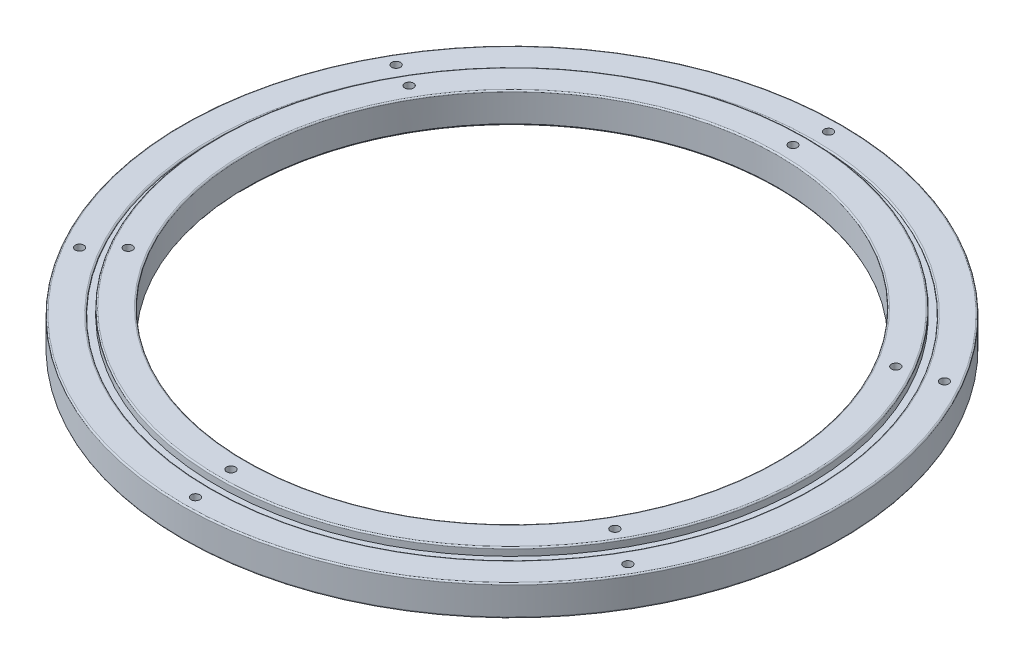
ISO-10303-21;
HEADER;
FILE_DESCRIPTION(('STEP AP214'),'2;1');
FILE_NAME('part.step','',(''),(''),'','','');
FILE_SCHEMA(('AUTOMOTIVE_DESIGN { 1 0 10303 214 1 1 1 1 }'));
ENDSEC;
DATA;
#1=APPLICATION_CONTEXT('core data for automotive mechanical design processes');
#2=APPLICATION_PROTOCOL_DEFINITION('international standard','automotive_design',2000,#1);
#3=PRODUCT_CONTEXT('',#1,'mechanical');
#4=PRODUCT('Part','Part','',(#3));
#5=PRODUCT_RELATED_PRODUCT_CATEGORY('part','',(#4));
#6=PRODUCT_DEFINITION_FORMATION('','',#4);
#7=PRODUCT_DEFINITION_CONTEXT('part definition',#1,'design');
#8=PRODUCT_DEFINITION('design','',#6,#7);
#9=PRODUCT_DEFINITION_SHAPE('','',#8);
#10=(LENGTH_UNIT() NAMED_UNIT(*) SI_UNIT(.MILLI.,.METRE.));
#11=(NAMED_UNIT(*) PLANE_ANGLE_UNIT() SI_UNIT($,.RADIAN.));
#12=(NAMED_UNIT(*) SI_UNIT($,.STERADIAN.) SOLID_ANGLE_UNIT());
#13=UNCERTAINTY_MEASURE_WITH_UNIT(LENGTH_MEASURE(1.E-05),#10,'distance_accuracy_value','');
#14=(GEOMETRIC_REPRESENTATION_CONTEXT(3) GLOBAL_UNCERTAINTY_ASSIGNED_CONTEXT((#13)) GLOBAL_UNIT_ASSIGNED_CONTEXT((#10,
#11,#12)) REPRESENTATION_CONTEXT('',''));
#15=CARTESIAN_POINT('',(0.,0.,0.));
#16=DIRECTION('',(0.,0.,1.));
#17=DIRECTION('',(1.,0.,0.));
#18=AXIS2_PLACEMENT_3D('',#15,#16,#17);
#19=CARTESIAN_POINT('',(-122.5169,16.9,0.));
#20=DIRECTION('',(0.,-1.,0.));
#21=DIRECTION('',(0.,0.,-1.));
#22=AXIS2_PLACEMENT_3D('',#19,#20,#21);
#23=PLANE('',#22);
#24=CARTESIAN_POINT('',(112.239923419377,16.9,-64.801749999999));
#25=DIRECTION('',(0.,1.,0.));
#26=DIRECTION('',(0.,0.,1.));
#27=AXIS2_PLACEMENT_3D('',#24,#25,#26);
#28=CIRCLE('',#27,2.);
#29=CARTESIAN_POINT('',(112.239923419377,16.9,-62.801749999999));
#30=VERTEX_POINT('',#29);
#31=EDGE_CURVE('E78',#30,#30,#28,.T.);
#32=ORIENTED_EDGE('',*,*,#31,.F.);
#33=EDGE_LOOP('',(#32));
#34=FACE_BOUND('',#33,.T.);
#35=CARTESIAN_POINT('',(0.,16.9,-129.6035));
#36=DIRECTION('',(0.,1.,0.));
#37=DIRECTION('',(0.,0.,1.));
#38=AXIS2_PLACEMENT_3D('',#35,#36,#37);
#39=CIRCLE('',#38,2.);
#40=CARTESIAN_POINT('',(0.,16.9,-127.6035));
#41=VERTEX_POINT('',#40);
#42=EDGE_CURVE('E74',#41,#41,#39,.T.);
#43=ORIENTED_EDGE('',*,*,#42,.F.);
#44=EDGE_LOOP('',(#43));
#45=FACE_BOUND('',#44,.T.);
#46=CARTESIAN_POINT('',(-112.239923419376,16.9,-64.8017500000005));
#47=DIRECTION('',(0.,1.,0.));
#48=DIRECTION('',(0.,0.,1.));
#49=AXIS2_PLACEMENT_3D('',#46,#47,#48);
#50=CIRCLE('',#49,2.);
#51=CARTESIAN_POINT('',(-112.239923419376,16.9,-62.8017500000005));
#52=VERTEX_POINT('',#51);
#53=EDGE_CURVE('E70',#52,#52,#50,.T.);
#54=ORIENTED_EDGE('',*,*,#53,.F.);
#55=EDGE_LOOP('',(#54));
#56=FACE_BOUND('',#55,.T.);
#57=CARTESIAN_POINT('',(-112.239923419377,16.9,64.8017499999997));
#58=DIRECTION('',(0.,1.,0.));
#59=DIRECTION('',(0.,0.,1.));
#60=AXIS2_PLACEMENT_3D('',#57,#58,#59);
#61=CIRCLE('',#60,2.);
#62=CARTESIAN_POINT('',(-112.239923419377,16.9,66.8017499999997));
#63=VERTEX_POINT('',#62);
#64=EDGE_CURVE('E65',#63,#63,#61,.T.);
#65=ORIENTED_EDGE('',*,*,#64,.F.);
#66=EDGE_LOOP('',(#65));
#67=FACE_BOUND('',#66,.T.);
#68=CARTESIAN_POINT('',(0.,16.9,129.6035));
#69=DIRECTION('',(0.,1.,0.));
#70=DIRECTION('',(0.,0.,1.));
#71=AXIS2_PLACEMENT_3D('',#68,#69,#70);
#72=CIRCLE('',#71,2.);
#73=CARTESIAN_POINT('',(0.,16.9,131.6035));
#74=VERTEX_POINT('',#73);
#75=EDGE_CURVE('E60',#74,#74,#72,.T.);
#76=ORIENTED_EDGE('',*,*,#75,.F.);
#77=EDGE_LOOP('',(#76));
#78=FACE_BOUND('',#77,.T.);
#79=CARTESIAN_POINT('',(0.,16.9,0.));
#80=DIRECTION('',(0.,-1.,0.));
#81=DIRECTION('',(0.,0.,-1.));
#82=AXIS2_PLACEMENT_3D('',#79,#80,#81);
#83=CIRCLE('',#82,135.14255);
#84=CARTESIAN_POINT('',(0.,16.9,-135.14255));
#85=VERTEX_POINT('',#84);
#86=EDGE_CURVE('E136',#85,#85,#83,.F.);
#87=ORIENTED_EDGE('',*,*,#86,.T.);
#88=EDGE_LOOP('',(#87));
#89=FACE_BOUND('',#88,.T.);
#90=CARTESIAN_POINT('',(0.,16.9,0.));
#91=DIRECTION('',(0.,-1.,0.));
#92=DIRECTION('',(0.,0.,-1.));
#93=AXIS2_PLACEMENT_3D('',#90,#91,#92);
#94=CIRCLE('',#93,123.1519);
#95=CARTESIAN_POINT('',(0.,16.9,-123.1519));
#96=VERTEX_POINT('',#95);
#97=EDGE_CURVE('E133',#96,#96,#94,.T.);
#98=ORIENTED_EDGE('',*,*,#97,.T.);
#99=EDGE_LOOP('',(#98));
#100=FACE_BOUND('',#99,.T.);
#101=CARTESIAN_POINT('',(112.239923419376,16.9,64.8017500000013));
#102=DIRECTION('',(0.,1.,0.));
#103=DIRECTION('',(0.,0.,1.));
#104=AXIS2_PLACEMENT_3D('',#101,#102,#103);
#105=CIRCLE('',#104,2.);
#106=CARTESIAN_POINT('',(112.239923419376,16.9,66.8017500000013));
#107=VERTEX_POINT('',#106);
#108=EDGE_CURVE('E557',#107,#107,#105,.T.);
#109=ORIENTED_EDGE('',*,*,#108,.F.);
#110=EDGE_LOOP('',(#109));
#111=FACE_BOUND('',#110,.T.);
#112=ADVANCED_FACE('F39',(#34,#45,#56,#67,#78,#89,#100,#111),#23,.F.);
#113=CARTESIAN_POINT('',(0.,0.,0.));
#114=DIRECTION('',(0.,-1.,0.));
#115=DIRECTION('',(0.,0.,-1.));
#116=AXIS2_PLACEMENT_3D('',#113,#114,#115);
#117=CYLINDRICAL_SURFACE('',#116,122.5169);
#118=CARTESIAN_POINT('',(0.,3.535,0.));
#119=DIRECTION('',(0.,1.,0.));
#120=DIRECTION('',(0.,0.,1.));
#121=AXIS2_PLACEMENT_3D('',#118,#119,#120);
#122=CIRCLE('',#121,122.5169);
#123=CARTESIAN_POINT('',(0.,3.535,122.5169));
#124=VERTEX_POINT('',#123);
#125=EDGE_CURVE('E142',#124,#124,#122,.F.);
#126=ORIENTED_EDGE('',*,*,#125,.T.);
#127=EDGE_LOOP('',(#126));
#128=FACE_BOUND('',#127,.T.);
#129=CARTESIAN_POINT('',(0.,16.265,0.));
#130=DIRECTION('',(0.,-1.,0.));
#131=DIRECTION('',(0.,0.,-1.));
#132=AXIS2_PLACEMENT_3D('',#129,#130,#131);
#133=CIRCLE('',#132,122.5169);
#134=CARTESIAN_POINT('',(0.,16.265,-122.5169));
#135=VERTEX_POINT('',#134);
#136=EDGE_CURVE('E139',#135,#135,#133,.F.);
#137=ORIENTED_EDGE('',*,*,#136,.T.);
#138=EDGE_LOOP('',(#137));
#139=FACE_BOUND('',#138,.T.);
#140=ADVANCED_FACE('F181',(#128,#139),#117,.F.);
#141=CARTESIAN_POINT('',(0.,0.,0.));
#142=DIRECTION('',(0.,-1.,0.));
#143=DIRECTION('',(0.,0.,-1.));
#144=AXIS2_PLACEMENT_3D('',#141,#142,#143);
#145=CYLINDRICAL_SURFACE('',#144,135.77755);
#146=CARTESIAN_POINT('',(0.,16.265,0.));
#147=DIRECTION('',(0.,-1.,0.));
#148=DIRECTION('',(0.,0.,-1.));
#149=AXIS2_PLACEMENT_3D('',#146,#147,#148);
#150=CIRCLE('',#149,135.77755);
#151=CARTESIAN_POINT('',(0.,16.265,-135.77755));
#152=VERTEX_POINT('',#151);
#153=EDGE_CURVE('E130',#152,#152,#150,.T.);
#154=ORIENTED_EDGE('',*,*,#153,.T.);
#155=EDGE_LOOP('',(#154));
#156=FACE_BOUND('',#155,.T.);
#157=CARTESIAN_POINT('',(0.,13.365,0.));
#158=DIRECTION('',(0.,-1.,0.));
#159=DIRECTION('',(0.,0.,-1.));
#160=AXIS2_PLACEMENT_3D('',#157,#158,#159);
#161=CIRCLE('',#160,135.77755);
#162=CARTESIAN_POINT('',(0.,13.365,-135.77755));
#163=VERTEX_POINT('',#162);
#164=EDGE_CURVE('E127',#163,#163,#161,.T.);
#165=ORIENTED_EDGE('',*,*,#164,.F.);
#166=EDGE_LOOP('',(#165));
#167=FACE_BOUND('',#166,.T.);
#168=ADVANCED_FACE('F187',(#156,#167),#145,.T.);
#169=CARTESIAN_POINT('',(-138.74935,13.365,0.));
#170=DIRECTION('',(0.,-1.,0.));
#171=DIRECTION('',(0.,0.,-1.));
#172=AXIS2_PLACEMENT_3D('',#169,#170,#171);
#173=PLANE('',#172);
#174=CARTESIAN_POINT('',(0.,13.365,0.));
#175=DIRECTION('',(0.,-1.,0.));
#176=DIRECTION('',(0.,0.,-1.));
#177=AXIS2_PLACEMENT_3D('',#174,#175,#176);
#178=CIRCLE('',#177,138.74935);
#179=CARTESIAN_POINT('',(0.,13.365,-138.74935));
#180=VERTEX_POINT('',#179);
#181=EDGE_CURVE('E124',#180,#180,#178,.T.);
#182=ORIENTED_EDGE('',*,*,#181,.F.);
#183=EDGE_LOOP('',(#182));
#184=FACE_BOUND('',#183,.T.);
#185=ORIENTED_EDGE('',*,*,#164,.T.);
#186=EDGE_LOOP('',(#185));
#187=FACE_BOUND('',#186,.T.);
#188=ADVANCED_FACE('F238',(#184,#187),#173,.F.);
#189=CARTESIAN_POINT('',(-138.74935,14.,0.));
#190=DIRECTION('',(0.,-1.,0.));
#191=DIRECTION('',(0.,0.,-1.));
#192=AXIS2_PLACEMENT_3D('',#189,#190,#191);
#193=PLANE('',#192);
#194=CARTESIAN_POINT('',(126.450014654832,14.,73.0059500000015));
#195=DIRECTION('',(0.,-1.,0.));
#196=DIRECTION('',(0.,0.,-1.));
#197=AXIS2_PLACEMENT_3D('',#194,#195,#196);
#198=CIRCLE('',#197,2.);
#199=CARTESIAN_POINT('',(126.450014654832,14.,71.0059500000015));
#200=VERTEX_POINT('',#199);
#201=EDGE_CURVE('E558',#200,#200,#198,.T.);
#202=ORIENTED_EDGE('',*,*,#201,.T.);
#203=EDGE_LOOP('',(#202));
#204=FACE_BOUND('',#203,.T.);
#205=CARTESIAN_POINT('',(126.450014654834,14.,-73.0059499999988));
#206=DIRECTION('',(0.,-1.,0.));
#207=DIRECTION('',(0.,0.,-1.));
#208=AXIS2_PLACEMENT_3D('',#205,#206,#207);
#209=CIRCLE('',#208,2.);
#210=CARTESIAN_POINT('',(126.450014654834,14.,-75.0059499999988));
#211=VERTEX_POINT('',#210);
#212=EDGE_CURVE('E85',#211,#211,#209,.T.);
#213=ORIENTED_EDGE('',*,*,#212,.T.);
#214=EDGE_LOOP('',(#213));
#215=FACE_BOUND('',#214,.T.);
#216=CARTESIAN_POINT('',(0.,14.,-146.0119));
#217=DIRECTION('',(0.,-1.,0.));
#218=DIRECTION('',(0.,0.,-1.));
#219=AXIS2_PLACEMENT_3D('',#216,#217,#218);
#220=CIRCLE('',#219,2.);
#221=CARTESIAN_POINT('',(0.,14.,-148.0119));
#222=VERTEX_POINT('',#221);
#223=EDGE_CURVE('E82',#222,#222,#220,.T.);
#224=ORIENTED_EDGE('',*,*,#223,.T.);
#225=EDGE_LOOP('',(#224));
#226=FACE_BOUND('',#225,.T.);
#227=CARTESIAN_POINT('',(-126.450014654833,14.,-73.0059500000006));
#228=DIRECTION('',(0.,-1.,0.));
#229=DIRECTION('',(0.,0.,-1.));
#230=AXIS2_PLACEMENT_3D('',#227,#228,#229);
#231=CIRCLE('',#230,2.);
#232=CARTESIAN_POINT('',(-126.450014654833,14.,-75.0059500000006));
#233=VERTEX_POINT('',#232);
#234=EDGE_CURVE('E100',#233,#233,#231,.T.);
#235=ORIENTED_EDGE('',*,*,#234,.T.);
#236=EDGE_LOOP('',(#235));
#237=FACE_BOUND('',#236,.T.);
#238=CARTESIAN_POINT('',(-126.450014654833,14.,73.0059499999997));
#239=DIRECTION('',(0.,-1.,0.));
#240=DIRECTION('',(0.,0.,-1.));
#241=AXIS2_PLACEMENT_3D('',#238,#239,#240);
#242=CIRCLE('',#241,2.);
#243=CARTESIAN_POINT('',(-126.450014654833,14.,71.0059499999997));
#244=VERTEX_POINT('',#243);
#245=EDGE_CURVE('E107',#244,#244,#242,.T.);
#246=ORIENTED_EDGE('',*,*,#245,.T.);
#247=EDGE_LOOP('',(#246));
#248=FACE_BOUND('',#247,.T.);
#249=CARTESIAN_POINT('',(0.,14.,146.0119));
#250=DIRECTION('',(0.,-1.,0.));
#251=DIRECTION('',(0.,0.,-1.));
#252=AXIS2_PLACEMENT_3D('',#249,#250,#251);
#253=CIRCLE('',#252,2.);
#254=CARTESIAN_POINT('',(0.,14.,144.0119));
#255=VERTEX_POINT('',#254);
#256=EDGE_CURVE('E114',#255,#255,#253,.T.);
#257=ORIENTED_EDGE('',*,*,#256,.T.);
#258=EDGE_LOOP('',(#257));
#259=FACE_BOUND('',#258,.T.);
#260=CARTESIAN_POINT('',(0.,14.,0.));
#261=DIRECTION('',(0.,-1.,0.));
#262=DIRECTION('',(0.,0.,-1.));
#263=AXIS2_PLACEMENT_3D('',#260,#261,#262);
#264=CIRCLE('',#263,151.375);
#265=CARTESIAN_POINT('',(0.,14.,-151.375));
#266=VERTEX_POINT('',#265);
#267=EDGE_CURVE('E160',#266,#266,#264,.F.);
#268=ORIENTED_EDGE('',*,*,#267,.T.);
#269=EDGE_LOOP('',(#268));
#270=FACE_BOUND('',#269,.T.);
#271=CARTESIAN_POINT('',(0.,14.,0.));
#272=DIRECTION('',(0.,-1.,0.));
#273=DIRECTION('',(0.,0.,-1.));
#274=AXIS2_PLACEMENT_3D('',#271,#272,#273);
#275=CIRCLE('',#274,139.38435);
#276=CARTESIAN_POINT('',(0.,14.,-139.38435));
#277=VERTEX_POINT('',#276);
#278=EDGE_CURVE('E157',#277,#277,#275,.T.);
#279=ORIENTED_EDGE('',*,*,#278,.T.);
#280=EDGE_LOOP('',(#279));
#281=FACE_BOUND('',#280,.T.);
#282=ADVANCED_FACE('F230',(#204,#215,#226,#237,#248,#259,#270,#281),#193,.F.);
#283=CARTESIAN_POINT('',(0.,0.,0.));
#284=DIRECTION('',(0.,-1.,0.));
#285=DIRECTION('',(0.,0.,-1.));
#286=AXIS2_PLACEMENT_3D('',#283,#284,#285);
#287=CYLINDRICAL_SURFACE('',#286,152.01);
#288=CARTESIAN_POINT('',(0.,13.365,0.));
#289=DIRECTION('',(0.,-1.,0.));
#290=DIRECTION('',(0.,0.,-1.));
#291=AXIS2_PLACEMENT_3D('',#288,#289,#290);
#292=CIRCLE('',#291,152.01);
#293=CARTESIAN_POINT('',(0.,13.365,-152.01));
#294=VERTEX_POINT('',#293);
#295=EDGE_CURVE('E154',#294,#294,#292,.T.);
#296=ORIENTED_EDGE('',*,*,#295,.T.);
#297=EDGE_LOOP('',(#296));
#298=FACE_BOUND('',#297,.T.);
#299=CARTESIAN_POINT('',(0.,0.635,0.));
#300=DIRECTION('',(0.,1.,0.));
#301=DIRECTION('',(0.,0.,1.));
#302=AXIS2_PLACEMENT_3D('',#299,#300,#301);
#303=CIRCLE('',#302,152.01);
#304=CARTESIAN_POINT('',(0.,0.635,152.01));
#305=VERTEX_POINT('',#304);
#306=EDGE_CURVE('E151',#305,#305,#303,.T.);
#307=ORIENTED_EDGE('',*,*,#306,.T.);
#308=EDGE_LOOP('',(#307));
#309=FACE_BOUND('',#308,.T.);
#310=ADVANCED_FACE('F221',(#298,#309),#287,.T.);
#311=CARTESIAN_POINT('',(-152.01,0.,0.));
#312=DIRECTION('',(0.,1.,0.));
#313=DIRECTION('',(0.,0.,1.));
#314=AXIS2_PLACEMENT_3D('',#311,#312,#313);
#315=PLANE('',#314);
#316=CARTESIAN_POINT('',(126.450014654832,0.,73.0059500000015));
#317=DIRECTION('',(0.,1.,0.));
#318=DIRECTION('',(0.,0.,1.));
#319=AXIS2_PLACEMENT_3D('',#316,#317,#318);
#320=CIRCLE('',#319,2.);
#321=CARTESIAN_POINT('',(126.450014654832,0.,75.0059500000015));
#322=VERTEX_POINT('',#321);
#323=EDGE_CURVE('E561',#322,#322,#320,.T.);
#324=ORIENTED_EDGE('',*,*,#323,.T.);
#325=EDGE_LOOP('',(#324));
#326=FACE_BOUND('',#325,.T.);
#327=CARTESIAN_POINT('',(126.450014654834,0.,-73.0059499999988));
#328=DIRECTION('',(0.,1.,0.));
#329=DIRECTION('',(0.,0.,1.));
#330=AXIS2_PLACEMENT_3D('',#327,#328,#329);
#331=CIRCLE('',#330,2.);
#332=CARTESIAN_POINT('',(126.450014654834,0.,-71.0059499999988));
#333=VERTEX_POINT('',#332);
#334=EDGE_CURVE('E90',#333,#333,#331,.T.);
#335=ORIENTED_EDGE('',*,*,#334,.T.);
#336=EDGE_LOOP('',(#335));
#337=FACE_BOUND('',#336,.T.);
#338=CARTESIAN_POINT('',(0.,0.,-146.0119));
#339=DIRECTION('',(0.,1.,0.));
#340=DIRECTION('',(0.,0.,1.));
#341=AXIS2_PLACEMENT_3D('',#338,#339,#340);
#342=CIRCLE('',#341,2.);
#343=CARTESIAN_POINT('',(0.,0.,-144.0119));
#344=VERTEX_POINT('',#343);
#345=EDGE_CURVE('E77',#344,#344,#342,.T.);
#346=ORIENTED_EDGE('',*,*,#345,.T.);
#347=EDGE_LOOP('',(#346));
#348=FACE_BOUND('',#347,.T.);
#349=CARTESIAN_POINT('',(-126.450014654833,0.,-73.0059500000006));
#350=DIRECTION('',(0.,1.,0.));
#351=DIRECTION('',(0.,0.,1.));
#352=AXIS2_PLACEMENT_3D('',#349,#350,#351);
#353=CIRCLE('',#352,2.);
#354=CARTESIAN_POINT('',(-126.450014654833,0.,-71.0059500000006));
#355=VERTEX_POINT('',#354);
#356=EDGE_CURVE('E73',#355,#355,#353,.T.);
#357=ORIENTED_EDGE('',*,*,#356,.T.);
#358=EDGE_LOOP('',(#357));
#359=FACE_BOUND('',#358,.T.);
#360=CARTESIAN_POINT('',(-126.450014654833,0.,73.0059499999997));
#361=DIRECTION('',(0.,1.,0.));
#362=DIRECTION('',(0.,0.,1.));
#363=AXIS2_PLACEMENT_3D('',#360,#361,#362);
#364=CIRCLE('',#363,2.);
#365=CARTESIAN_POINT('',(-126.450014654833,0.,75.0059499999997));
#366=VERTEX_POINT('',#365);
#367=EDGE_CURVE('E69',#366,#366,#364,.T.);
#368=ORIENTED_EDGE('',*,*,#367,.T.);
#369=EDGE_LOOP('',(#368));
#370=FACE_BOUND('',#369,.T.);
#371=CARTESIAN_POINT('',(0.,0.,146.0119));
#372=DIRECTION('',(0.,1.,0.));
#373=DIRECTION('',(0.,0.,1.));
#374=AXIS2_PLACEMENT_3D('',#371,#372,#373);
#375=CIRCLE('',#374,2.);
#376=CARTESIAN_POINT('',(0.,0.,148.0119));
#377=VERTEX_POINT('',#376);
#378=EDGE_CURVE('E64',#377,#377,#375,.T.);
#379=ORIENTED_EDGE('',*,*,#378,.T.);
#380=EDGE_LOOP('',(#379));
#381=FACE_BOUND('',#380,.T.);
#382=CARTESIAN_POINT('',(0.,0.,0.));
#383=DIRECTION('',(0.,1.,0.));
#384=DIRECTION('',(0.,0.,1.));
#385=AXIS2_PLACEMENT_3D('',#382,#383,#384);
#386=CIRCLE('',#385,151.375);
#387=CARTESIAN_POINT('',(0.,0.,151.375));
#388=VERTEX_POINT('',#387);
#389=EDGE_CURVE('E47',#388,#388,#386,.F.);
#390=ORIENTED_EDGE('',*,*,#389,.T.);
#391=EDGE_LOOP('',(#390));
#392=FACE_BOUND('',#391,.T.);
#393=CARTESIAN_POINT('',(0.,0.,0.));
#394=DIRECTION('',(0.,1.,0.));
#395=DIRECTION('',(0.,0.,1.));
#396=AXIS2_PLACEMENT_3D('',#393,#394,#395);
#397=CIRCLE('',#396,139.38435);
#398=CARTESIAN_POINT('',(0.,0.,139.38435));
#399=VERTEX_POINT('',#398);
#400=EDGE_CURVE('E52',#399,#399,#397,.T.);
#401=ORIENTED_EDGE('',*,*,#400,.T.);
#402=EDGE_LOOP('',(#401));
#403=FACE_BOUND('',#402,.T.);
#404=ADVANCED_FACE('F165',(#326,#337,#348,#359,#370,#381,#392,#403),#315,.F.);
#405=CARTESIAN_POINT('',(0.,0.,0.));
#406=DIRECTION('',(0.,-1.,0.));
#407=DIRECTION('',(0.,0.,-1.));
#408=AXIS2_PLACEMENT_3D('',#405,#406,#407);
#409=CYLINDRICAL_SURFACE('',#408,138.74935);
#410=CARTESIAN_POINT('',(0.,0.635,0.));
#411=DIRECTION('',(0.,1.,0.));
#412=DIRECTION('',(0.,0.,1.));
#413=AXIS2_PLACEMENT_3D('',#410,#411,#412);
#414=CIRCLE('',#413,138.74935);
#415=CARTESIAN_POINT('',(0.,0.635,138.74935));
#416=VERTEX_POINT('',#415);
#417=EDGE_CURVE('E10',#416,#416,#414,.F.);
#418=ORIENTED_EDGE('',*,*,#417,.T.);
#419=EDGE_LOOP('',(#418));
#420=FACE_BOUND('',#419,.T.);
#421=CARTESIAN_POINT('',(0.,3.535,0.));
#422=DIRECTION('',(0.,-1.,0.));
#423=DIRECTION('',(0.,0.,-1.));
#424=AXIS2_PLACEMENT_3D('',#421,#422,#423);
#425=CIRCLE('',#424,138.74935);
#426=CARTESIAN_POINT('',(0.,3.535,-138.74935));
#427=VERTEX_POINT('',#426);
#428=EDGE_CURVE('E121',#427,#427,#425,.T.);
#429=ORIENTED_EDGE('',*,*,#428,.F.);
#430=EDGE_LOOP('',(#429));
#431=FACE_BOUND('',#430,.T.);
#432=ADVANCED_FACE('F220',(#420,#431),#409,.F.);
#433=CARTESIAN_POINT('',(-135.77755,3.535,0.));
#434=DIRECTION('',(0.,1.,0.));
#435=DIRECTION('',(0.,0.,1.));
#436=AXIS2_PLACEMENT_3D('',#433,#434,#435);
#437=PLANE('',#436);
#438=CARTESIAN_POINT('',(0.,3.535,0.));
#439=DIRECTION('',(0.,-1.,0.));
#440=DIRECTION('',(0.,0.,-1.));
#441=AXIS2_PLACEMENT_3D('',#438,#439,#440);
#442=CIRCLE('',#441,135.77755);
#443=CARTESIAN_POINT('',(0.,3.535,-135.77755));
#444=VERTEX_POINT('',#443);
#445=EDGE_CURVE('E59',#444,#444,#442,.T.);
#446=ORIENTED_EDGE('',*,*,#445,.F.);
#447=EDGE_LOOP('',(#446));
#448=FACE_BOUND('',#447,.T.);
#449=ORIENTED_EDGE('',*,*,#428,.T.);
#450=EDGE_LOOP('',(#449));
#451=FACE_BOUND('',#450,.T.);
#452=ADVANCED_FACE('F228',(#448,#451),#437,.F.);
#453=CARTESIAN_POINT('',(-135.77755,2.9,0.));
#454=DIRECTION('',(0.,1.,0.));
#455=DIRECTION('',(0.,0.,1.));
#456=AXIS2_PLACEMENT_3D('',#453,#454,#455);
#457=PLANE('',#456);
#458=CARTESIAN_POINT('',(112.239923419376,2.9,64.8017500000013));
#459=DIRECTION('',(0.,1.,0.));
#460=DIRECTION('',(0.,0.,1.));
#461=AXIS2_PLACEMENT_3D('',#458,#459,#460);
#462=CIRCLE('',#461,2.);
#463=CARTESIAN_POINT('',(112.239923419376,2.9,66.8017500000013));
#464=VERTEX_POINT('',#463);
#465=EDGE_CURVE('E43',#464,#464,#462,.T.);
#466=ORIENTED_EDGE('',*,*,#465,.T.);
#467=EDGE_LOOP('',(#466));
#468=FACE_BOUND('',#467,.T.);
#469=CARTESIAN_POINT('',(112.239923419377,2.9,-64.801749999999));
#470=DIRECTION('',(0.,1.,0.));
#471=DIRECTION('',(0.,0.,1.));
#472=AXIS2_PLACEMENT_3D('',#469,#470,#471);
#473=CIRCLE('',#472,2.);
#474=CARTESIAN_POINT('',(112.239923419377,2.9,-62.801749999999));
#475=VERTEX_POINT('',#474);
#476=EDGE_CURVE('E75',#475,#475,#473,.T.);
#477=ORIENTED_EDGE('',*,*,#476,.T.);
#478=EDGE_LOOP('',(#477));
#479=FACE_BOUND('',#478,.T.);
#480=CARTESIAN_POINT('',(0.,2.9,-129.6035));
#481=DIRECTION('',(0.,1.,0.));
#482=DIRECTION('',(0.,0.,1.));
#483=AXIS2_PLACEMENT_3D('',#480,#481,#482);
#484=CIRCLE('',#483,2.);
#485=CARTESIAN_POINT('',(0.,2.9,-127.6035));
#486=VERTEX_POINT('',#485);
#487=EDGE_CURVE('E71',#486,#486,#484,.T.);
#488=ORIENTED_EDGE('',*,*,#487,.T.);
#489=EDGE_LOOP('',(#488));
#490=FACE_BOUND('',#489,.T.);
#491=CARTESIAN_POINT('',(-112.239923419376,2.9,-64.8017500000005));
#492=DIRECTION('',(0.,1.,0.));
#493=DIRECTION('',(0.,0.,1.));
#494=AXIS2_PLACEMENT_3D('',#491,#492,#493);
#495=CIRCLE('',#494,2.);
#496=CARTESIAN_POINT('',(-112.239923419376,2.9,-62.8017500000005));
#497=VERTEX_POINT('',#496);
#498=EDGE_CURVE('E66',#497,#497,#495,.T.);
#499=ORIENTED_EDGE('',*,*,#498,.T.);
#500=EDGE_LOOP('',(#499));
#501=FACE_BOUND('',#500,.T.);
#502=CARTESIAN_POINT('',(-112.239923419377,2.9,64.8017499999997));
#503=DIRECTION('',(0.,1.,0.));
#504=DIRECTION('',(0.,0.,1.));
#505=AXIS2_PLACEMENT_3D('',#502,#503,#504);
#506=CIRCLE('',#505,2.);
#507=CARTESIAN_POINT('',(-112.239923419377,2.9,66.8017499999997));
#508=VERTEX_POINT('',#507);
#509=EDGE_CURVE('E61',#508,#508,#506,.T.);
#510=ORIENTED_EDGE('',*,*,#509,.T.);
#511=EDGE_LOOP('',(#510));
#512=FACE_BOUND('',#511,.T.);
#513=CARTESIAN_POINT('',(0.,2.9,129.6035));
#514=DIRECTION('',(0.,1.,0.));
#515=DIRECTION('',(0.,0.,1.));
#516=AXIS2_PLACEMENT_3D('',#513,#514,#515);
#517=CIRCLE('',#516,2.);
#518=CARTESIAN_POINT('',(0.,2.9,131.6035));
#519=VERTEX_POINT('',#518);
#520=EDGE_CURVE('E56',#519,#519,#517,.T.);
#521=ORIENTED_EDGE('',*,*,#520,.T.);
#522=EDGE_LOOP('',(#521));
#523=FACE_BOUND('',#522,.T.);
#524=CARTESIAN_POINT('',(0.,2.9,0.));
#525=DIRECTION('',(0.,1.,0.));
#526=DIRECTION('',(0.,0.,1.));
#527=AXIS2_PLACEMENT_3D('',#524,#525,#526);
#528=CIRCLE('',#527,123.1519);
#529=CARTESIAN_POINT('',(0.,2.9,123.1519));
#530=VERTEX_POINT('',#529);
#531=EDGE_CURVE('E148',#530,#530,#528,.T.);
#532=ORIENTED_EDGE('',*,*,#531,.T.);
#533=EDGE_LOOP('',(#532));
#534=FACE_BOUND('',#533,.T.);
#535=CARTESIAN_POINT('',(0.,2.9,0.));
#536=DIRECTION('',(0.,1.,0.));
#537=DIRECTION('',(0.,0.,1.));
#538=AXIS2_PLACEMENT_3D('',#535,#536,#537);
#539=CIRCLE('',#538,135.14255);
#540=CARTESIAN_POINT('',(0.,2.9,135.14255));
#541=VERTEX_POINT('',#540);
#542=EDGE_CURVE('E145',#541,#541,#539,.F.);
#543=ORIENTED_EDGE('',*,*,#542,.T.);
#544=EDGE_LOOP('',(#543));
#545=FACE_BOUND('',#544,.T.);
#546=ADVANCED_FACE('F198',(#468,#479,#490,#501,#512,#523,#534,#545),#457,.F.);
#547=CARTESIAN_POINT('',(0.,16.265,0.));
#548=DIRECTION('',(0.,-1.,0.));
#549=DIRECTION('',(0.,0.,-1.));
#550=AXIS2_PLACEMENT_3D('',#547,#548,#549);
#551=TOROIDAL_SURFACE('',#550,135.14255,0.635);
#552=ORIENTED_EDGE('',*,*,#86,.F.);
#553=EDGE_LOOP('',(#552));
#554=FACE_BOUND('',#553,.T.);
#555=ORIENTED_EDGE('',*,*,#153,.F.);
#556=EDGE_LOOP('',(#555));
#557=FACE_BOUND('',#556,.T.);
#558=ADVANCED_FACE('F194',(#554,#557),#551,.T.);
#559=CARTESIAN_POINT('',(0.,3.535,0.));
#560=DIRECTION('',(0.,1.,0.));
#561=DIRECTION('',(0.,0.,1.));
#562=AXIS2_PLACEMENT_3D('',#559,#560,#561);
#563=TOROIDAL_SURFACE('',#562,123.1519,0.635);
#564=ORIENTED_EDGE('',*,*,#531,.F.);
#565=EDGE_LOOP('',(#564));
#566=FACE_BOUND('',#565,.T.);
#567=ORIENTED_EDGE('',*,*,#125,.F.);
#568=EDGE_LOOP('',(#567));
#569=FACE_BOUND('',#568,.T.);
#570=ADVANCED_FACE('F197',(#566,#569),#563,.T.);
#571=CARTESIAN_POINT('',(0.,16.265,0.));
#572=DIRECTION('',(0.,-1.,0.));
#573=DIRECTION('',(0.,0.,-1.));
#574=AXIS2_PLACEMENT_3D('',#571,#572,#573);
#575=TOROIDAL_SURFACE('',#574,123.1519,0.635);
#576=ORIENTED_EDGE('',*,*,#136,.F.);
#577=EDGE_LOOP('',(#576));
#578=FACE_BOUND('',#577,.T.);
#579=ORIENTED_EDGE('',*,*,#97,.F.);
#580=EDGE_LOOP('',(#579));
#581=FACE_BOUND('',#580,.T.);
#582=ADVANCED_FACE('F202',(#578,#581),#575,.T.);
#583=CARTESIAN_POINT('',(0.,13.365,0.));
#584=DIRECTION('',(0.,-1.,0.));
#585=DIRECTION('',(0.,0.,-1.));
#586=AXIS2_PLACEMENT_3D('',#583,#584,#585);
#587=TOROIDAL_SURFACE('',#586,151.375,0.635);
#588=ORIENTED_EDGE('',*,*,#267,.F.);
#589=EDGE_LOOP('',(#588));
#590=FACE_BOUND('',#589,.T.);
#591=ORIENTED_EDGE('',*,*,#295,.F.);
#592=EDGE_LOOP('',(#591));
#593=FACE_BOUND('',#592,.T.);
#594=ADVANCED_FACE('F206',(#590,#593),#587,.T.);
#595=CARTESIAN_POINT('',(0.,0.635,0.));
#596=DIRECTION('',(0.,1.,0.));
#597=DIRECTION('',(0.,0.,1.));
#598=AXIS2_PLACEMENT_3D('',#595,#596,#597);
#599=TOROIDAL_SURFACE('',#598,151.375,0.635);
#600=ORIENTED_EDGE('',*,*,#306,.F.);
#601=EDGE_LOOP('',(#600));
#602=FACE_BOUND('',#601,.T.);
#603=ORIENTED_EDGE('',*,*,#389,.F.);
#604=EDGE_LOOP('',(#603));
#605=FACE_BOUND('',#604,.T.);
#606=ADVANCED_FACE('F177',(#602,#605),#599,.T.);
#607=CARTESIAN_POINT('',(0.,3.535,0.));
#608=DIRECTION('',(0.,1.,0.));
#609=DIRECTION('',(0.,0.,1.));
#610=AXIS2_PLACEMENT_3D('',#607,#608,#609);
#611=TOROIDAL_SURFACE('',#610,135.14255,0.635);
#612=ORIENTED_EDGE('',*,*,#445,.T.);
#613=EDGE_LOOP('',(#612));
#614=FACE_BOUND('',#613,.T.);
#615=ORIENTED_EDGE('',*,*,#542,.F.);
#616=EDGE_LOOP('',(#615));
#617=FACE_BOUND('',#616,.T.);
#618=ADVANCED_FACE('F170',(#614,#617),#611,.T.);
#619=CARTESIAN_POINT('',(0.,0.635,0.));
#620=DIRECTION('',(0.,1.,0.));
#621=DIRECTION('',(0.,0.,1.));
#622=AXIS2_PLACEMENT_3D('',#619,#620,#621);
#623=TOROIDAL_SURFACE('',#622,139.38435,0.635);
#624=ORIENTED_EDGE('',*,*,#400,.F.);
#625=EDGE_LOOP('',(#624));
#626=FACE_BOUND('',#625,.T.);
#627=ORIENTED_EDGE('',*,*,#417,.F.);
#628=EDGE_LOOP('',(#627));
#629=FACE_BOUND('',#628,.T.);
#630=ADVANCED_FACE('F167',(#626,#629),#623,.T.);
#631=CARTESIAN_POINT('',(0.,13.365,0.));
#632=DIRECTION('',(0.,-1.,0.));
#633=DIRECTION('',(0.,0.,-1.));
#634=AXIS2_PLACEMENT_3D('',#631,#632,#633);
#635=TOROIDAL_SURFACE('',#634,139.38435,0.635);
#636=ORIENTED_EDGE('',*,*,#181,.T.);
#637=EDGE_LOOP('',(#636));
#638=FACE_BOUND('',#637,.T.);
#639=ORIENTED_EDGE('',*,*,#278,.F.);
#640=EDGE_LOOP('',(#639));
#641=FACE_BOUND('',#640,.T.);
#642=ADVANCED_FACE('F41',(#638,#641),#635,.T.);
#643=CARTESIAN_POINT('',(0.,16.9,129.6035));
#644=DIRECTION('',(0.,1.,0.));
#645=DIRECTION('',(0.,0.,1.));
#646=AXIS2_PLACEMENT_3D('',#643,#644,#645);
#647=CYLINDRICAL_SURFACE('',#646,2.);
#648=ORIENTED_EDGE('',*,*,#75,.T.);
#649=EDGE_LOOP('',(#648));
#650=FACE_BOUND('',#649,.T.);
#651=ORIENTED_EDGE('',*,*,#520,.F.);
#652=EDGE_LOOP('',(#651));
#653=FACE_BOUND('',#652,.T.);
#654=ADVANCED_FACE('F175',(#650,#653),#647,.F.);
#655=CARTESIAN_POINT('',(0.,16.9,146.0119));
#656=DIRECTION('',(0.,1.,0.));
#657=DIRECTION('',(0.,0.,1.));
#658=AXIS2_PLACEMENT_3D('',#655,#656,#657);
#659=CYLINDRICAL_SURFACE('',#658,2.);
#660=ORIENTED_EDGE('',*,*,#378,.F.);
#661=EDGE_LOOP('',(#660));
#662=FACE_BOUND('',#661,.T.);
#663=ORIENTED_EDGE('',*,*,#256,.F.);
#664=EDGE_LOOP('',(#663));
#665=FACE_BOUND('',#664,.T.);
#666=ADVANCED_FACE('F372',(#662,#665),#659,.F.);
#667=CARTESIAN_POINT('',(-112.239923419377,16.9,64.8017499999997));
#668=DIRECTION('',(0.,1.,0.));
#669=DIRECTION('',(0.,0.,1.));
#670=AXIS2_PLACEMENT_3D('',#667,#668,#669);
#671=CYLINDRICAL_SURFACE('',#670,2.);
#672=ORIENTED_EDGE('',*,*,#64,.T.);
#673=EDGE_LOOP('',(#672));
#674=FACE_BOUND('',#673,.T.);
#675=ORIENTED_EDGE('',*,*,#509,.F.);
#676=EDGE_LOOP('',(#675));
#677=FACE_BOUND('',#676,.T.);
#678=ADVANCED_FACE('F382',(#674,#677),#671,.F.);
#679=CARTESIAN_POINT('',(-126.450014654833,16.9,73.0059499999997));
#680=DIRECTION('',(0.,1.,0.));
#681=DIRECTION('',(0.,0.,1.));
#682=AXIS2_PLACEMENT_3D('',#679,#680,#681);
#683=CYLINDRICAL_SURFACE('',#682,2.);
#684=ORIENTED_EDGE('',*,*,#367,.F.);
#685=EDGE_LOOP('',(#684));
#686=FACE_BOUND('',#685,.T.);
#687=ORIENTED_EDGE('',*,*,#245,.F.);
#688=EDGE_LOOP('',(#687));
#689=FACE_BOUND('',#688,.T.);
#690=ADVANCED_FACE('F401',(#686,#689),#683,.F.);
#691=CARTESIAN_POINT('',(-112.239923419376,16.9,-64.8017500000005));
#692=DIRECTION('',(0.,1.,0.));
#693=DIRECTION('',(0.,0.,1.));
#694=AXIS2_PLACEMENT_3D('',#691,#692,#693);
#695=CYLINDRICAL_SURFACE('',#694,2.);
#696=ORIENTED_EDGE('',*,*,#53,.T.);
#697=EDGE_LOOP('',(#696));
#698=FACE_BOUND('',#697,.T.);
#699=ORIENTED_EDGE('',*,*,#498,.F.);
#700=EDGE_LOOP('',(#699));
#701=FACE_BOUND('',#700,.T.);
#702=ADVANCED_FACE('F411',(#698,#701),#695,.F.);
#703=CARTESIAN_POINT('',(-126.450014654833,16.9,-73.0059500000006));
#704=DIRECTION('',(0.,1.,0.));
#705=DIRECTION('',(0.,0.,1.));
#706=AXIS2_PLACEMENT_3D('',#703,#704,#705);
#707=CYLINDRICAL_SURFACE('',#706,2.);
#708=ORIENTED_EDGE('',*,*,#356,.F.);
#709=EDGE_LOOP('',(#708));
#710=FACE_BOUND('',#709,.T.);
#711=ORIENTED_EDGE('',*,*,#234,.F.);
#712=EDGE_LOOP('',(#711));
#713=FACE_BOUND('',#712,.T.);
#714=ADVANCED_FACE('F421',(#710,#713),#707,.F.);
#715=CARTESIAN_POINT('',(0.,16.9,-129.6035));
#716=DIRECTION('',(0.,1.,0.));
#717=DIRECTION('',(0.,0.,1.));
#718=AXIS2_PLACEMENT_3D('',#715,#716,#717);
#719=CYLINDRICAL_SURFACE('',#718,2.);
#720=ORIENTED_EDGE('',*,*,#42,.T.);
#721=EDGE_LOOP('',(#720));
#722=FACE_BOUND('',#721,.T.);
#723=ORIENTED_EDGE('',*,*,#487,.F.);
#724=EDGE_LOOP('',(#723));
#725=FACE_BOUND('',#724,.T.);
#726=ADVANCED_FACE('F431',(#722,#725),#719,.F.);
#727=CARTESIAN_POINT('',(0.,16.9,-146.0119));
#728=DIRECTION('',(0.,1.,0.));
#729=DIRECTION('',(0.,0.,1.));
#730=AXIS2_PLACEMENT_3D('',#727,#728,#729);
#731=CYLINDRICAL_SURFACE('',#730,2.);
#732=ORIENTED_EDGE('',*,*,#345,.F.);
#733=EDGE_LOOP('',(#732));
#734=FACE_BOUND('',#733,.T.);
#735=ORIENTED_EDGE('',*,*,#223,.F.);
#736=EDGE_LOOP('',(#735));
#737=FACE_BOUND('',#736,.T.);
#738=ADVANCED_FACE('F441',(#734,#737),#731,.F.);
#739=CARTESIAN_POINT('',(112.239923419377,16.9,-64.801749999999));
#740=DIRECTION('',(0.,1.,0.));
#741=DIRECTION('',(0.,0.,1.));
#742=AXIS2_PLACEMENT_3D('',#739,#740,#741);
#743=CYLINDRICAL_SURFACE('',#742,2.);
#744=ORIENTED_EDGE('',*,*,#31,.T.);
#745=EDGE_LOOP('',(#744));
#746=FACE_BOUND('',#745,.T.);
#747=ORIENTED_EDGE('',*,*,#476,.F.);
#748=EDGE_LOOP('',(#747));
#749=FACE_BOUND('',#748,.T.);
#750=ADVANCED_FACE('F451',(#746,#749),#743,.F.);
#751=CARTESIAN_POINT('',(126.450014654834,16.9,-73.0059499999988));
#752=DIRECTION('',(0.,1.,0.));
#753=DIRECTION('',(0.,0.,1.));
#754=AXIS2_PLACEMENT_3D('',#751,#752,#753);
#755=CYLINDRICAL_SURFACE('',#754,2.);
#756=ORIENTED_EDGE('',*,*,#334,.F.);
#757=EDGE_LOOP('',(#756));
#758=FACE_BOUND('',#757,.T.);
#759=ORIENTED_EDGE('',*,*,#212,.F.);
#760=EDGE_LOOP('',(#759));
#761=FACE_BOUND('',#760,.T.);
#762=ADVANCED_FACE('F461',(#758,#761),#755,.F.);
#763=CARTESIAN_POINT('',(112.239923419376,16.9,64.8017500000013));
#764=DIRECTION('',(0.,1.,0.));
#765=DIRECTION('',(0.,0.,1.));
#766=AXIS2_PLACEMENT_3D('',#763,#764,#765);
#767=CYLINDRICAL_SURFACE('',#766,2.);
#768=ORIENTED_EDGE('',*,*,#108,.T.);
#769=EDGE_LOOP('',(#768));
#770=FACE_BOUND('',#769,.T.);
#771=ORIENTED_EDGE('',*,*,#465,.F.);
#772=EDGE_LOOP('',(#771));
#773=FACE_BOUND('',#772,.T.);
#774=ADVANCED_FACE('F470',(#770,#773),#767,.F.);
#775=CARTESIAN_POINT('',(126.450014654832,16.9,73.0059500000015));
#776=DIRECTION('',(0.,1.,0.));
#777=DIRECTION('',(0.,0.,1.));
#778=AXIS2_PLACEMENT_3D('',#775,#776,#777);
#779=CYLINDRICAL_SURFACE('',#778,2.);
#780=ORIENTED_EDGE('',*,*,#323,.F.);
#781=EDGE_LOOP('',(#780));
#782=FACE_BOUND('',#781,.T.);
#783=ORIENTED_EDGE('',*,*,#201,.F.);
#784=EDGE_LOOP('',(#783));
#785=FACE_BOUND('',#784,.T.);
#786=ADVANCED_FACE('F480',(#782,#785),#779,.F.);
#787=CLOSED_SHELL('',(#112,#140,#168,#188,#282,#310,#404,#432,#452,#546,#558,#570,#582,#594,
#606,#618,#630,#642,#654,#666,#678,#690,#702,#714,#726,#738,#750,#762,#774,#786));
#788=MANIFOLD_SOLID_BREP('B2',#787);
#789=ADVANCED_BREP_SHAPE_REPRESENTATION('',(#18,#788),#14);
#790=SHAPE_DEFINITION_REPRESENTATION(#9,#789);
ENDSEC;
END-ISO-10303-21;
